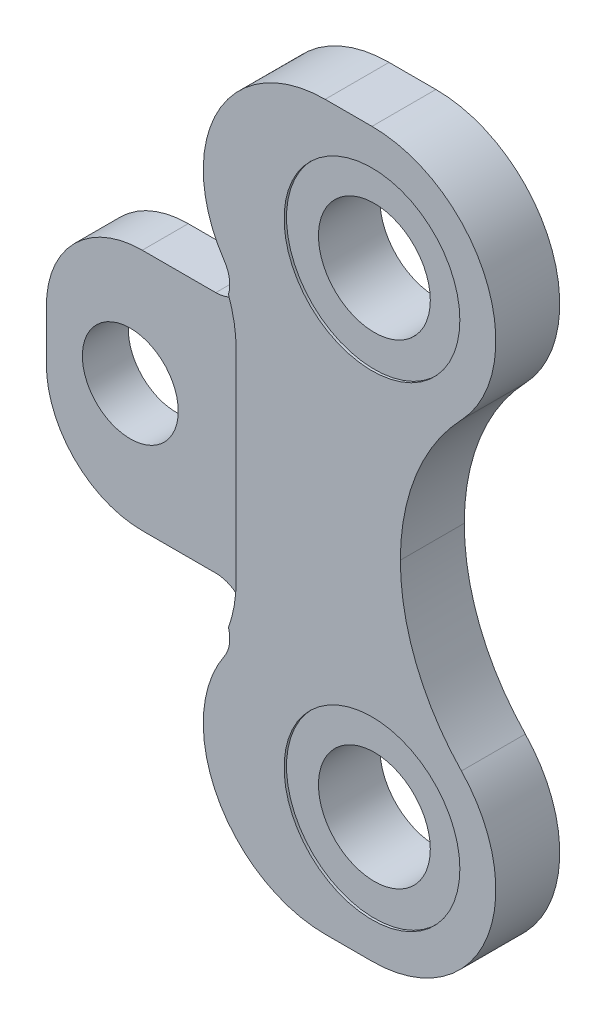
ISO-10303-21;
HEADER;
FILE_DESCRIPTION(('STEP AP214'),'2;1');
FILE_NAME('part.step','',(''),(''),'','','');
FILE_SCHEMA(('AUTOMOTIVE_DESIGN { 1 0 10303 214 1 1 1 1 }'));
ENDSEC;
DATA;
#1=APPLICATION_CONTEXT('core data for automotive mechanical design processes');
#2=APPLICATION_PROTOCOL_DEFINITION('international standard','automotive_design',2000,#1);
#3=PRODUCT_CONTEXT('',#1,'mechanical');
#4=PRODUCT('Part','Part','',(#3));
#5=PRODUCT_RELATED_PRODUCT_CATEGORY('part','',(#4));
#6=PRODUCT_DEFINITION_FORMATION('','',#4);
#7=PRODUCT_DEFINITION_CONTEXT('part definition',#1,'design');
#8=PRODUCT_DEFINITION('design','',#6,#7);
#9=PRODUCT_DEFINITION_SHAPE('','',#8);
#10=(LENGTH_UNIT() NAMED_UNIT(*) SI_UNIT(.MILLI.,.METRE.));
#11=(NAMED_UNIT(*) PLANE_ANGLE_UNIT() SI_UNIT($,.RADIAN.));
#12=(NAMED_UNIT(*) SI_UNIT($,.STERADIAN.) SOLID_ANGLE_UNIT());
#13=UNCERTAINTY_MEASURE_WITH_UNIT(LENGTH_MEASURE(1.E-05),#10,'distance_accuracy_value','');
#14=(GEOMETRIC_REPRESENTATION_CONTEXT(3) GLOBAL_UNCERTAINTY_ASSIGNED_CONTEXT((#13)) GLOBAL_UNIT_ASSIGNED_CONTEXT((#10,
#11,#12)) REPRESENTATION_CONTEXT('',''));
#15=CARTESIAN_POINT('',(0.,0.,0.));
#16=DIRECTION('',(0.,0.,1.));
#17=DIRECTION('',(1.,0.,0.));
#18=AXIS2_PLACEMENT_3D('',#15,#16,#17);
#19=CARTESIAN_POINT('',(1.5,3.2,8.));
#20=DIRECTION('',(0.,0.,-1.));
#21=DIRECTION('',(-1.,0.,0.));
#22=AXIS2_PLACEMENT_3D('',#19,#20,#21);
#23=PLANE('',#22);
#24=CARTESIAN_POINT('',(32.5,-29.75,8.));
#25=DIRECTION('',(0.,0.,-1.));
#26=DIRECTION('',(1.,0.,0.));
#27=AXIS2_PLACEMENT_3D('',#24,#25,#26);
#28=CIRCLE('',#27,11.);
#29=CARTESIAN_POINT('',(43.5,-29.75,8.));
#30=VERTEX_POINT('',#29);
#31=EDGE_CURVE('E217',#30,#30,#28,.T.);
#32=ORIENTED_EDGE('',*,*,#31,.T.);
#33=EDGE_LOOP('',(#32));
#34=FACE_BOUND('',#33,.T.);
#35=CARTESIAN_POINT('',(32.5,29.75,8.));
#36=DIRECTION('',(0.,0.,1.));
#37=DIRECTION('',(1.,0.,0.));
#38=AXIS2_PLACEMENT_3D('',#35,#36,#37);
#39=CIRCLE('',#38,11.);
#40=CARTESIAN_POINT('',(43.5,29.75,8.));
#41=VERTEX_POINT('',#40);
#42=EDGE_CURVE('E291',#41,#41,#39,.T.);
#43=ORIENTED_EDGE('',*,*,#42,.F.);
#44=EDGE_LOOP('',(#43));
#45=FACE_BOUND('',#44,.T.);
#46=CARTESIAN_POINT('',(-1.,-12.5,8.));
#47=DIRECTION('',(0.,0.,-1.));
#48=DIRECTION('',(1.,0.,0.));
#49=AXIS2_PLACEMENT_3D('',#46,#47,#48);
#50=CIRCLE('',#49,16.5);
#51=CARTESIAN_POINT('',(15.5,-12.5,8.));
#52=VERTEX_POINT('',#51);
#53=CARTESIAN_POINT('',(14.5342457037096,-18.0621228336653,8.));
#54=VERTEX_POINT('',#53);
#55=EDGE_CURVE('E201',#52,#54,#50,.T.);
#56=ORIENTED_EDGE('',*,*,#55,.T.);
#57=CARTESIAN_POINT('',(10.7,-19.201666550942,8.));
#58=DIRECTION('',(0.,0.,1.));
#59=DIRECTION('',(1.,0.,0.));
#60=AXIS2_PLACEMENT_3D('',#57,#58,#59);
#61=CIRCLE('',#60,4.);
#62=CARTESIAN_POINT('',(14.0113922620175,-21.4454760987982,8.));
#63=VERTEX_POINT('',#62);
#64=EDGE_CURVE('E228',#63,#54,#61,.T.);
#65=ORIENTED_EDGE('',*,*,#64,.F.);
#66=CARTESIAN_POINT('',(26.6360752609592,-30.,8.));
#67=DIRECTION('',(0.,0.,-1.));
#68=DIRECTION('',(1.,0.,0.));
#69=AXIS2_PLACEMENT_3D('',#66,#67,#68);
#70=CIRCLE('',#69,15.25);
#71=CARTESIAN_POINT('',(26.6360752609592,-45.25,8.));
#72=VERTEX_POINT('',#71);
#73=EDGE_CURVE('E231',#72,#63,#70,.T.);
#74=ORIENTED_EDGE('',*,*,#73,.F.);
#75=DIRECTION('',(-1.,0.,0.));
#76=VECTOR('',#75,1.);
#77=CARTESIAN_POINT('',(32.5,-45.25,8.));
#78=LINE('',#77,#76);
#79=CARTESIAN_POINT('',(32.5,-45.25,8.));
#80=VERTEX_POINT('',#79);
#81=EDGE_CURVE('E235',#80,#72,#78,.T.);
#82=ORIENTED_EDGE('',*,*,#81,.F.);
#83=CARTESIAN_POINT('',(32.5,-29.75,8.));
#84=DIRECTION('',(0.,0.,-1.));
#85=DIRECTION('',(-1.,0.,0.));
#86=AXIS2_PLACEMENT_3D('',#83,#84,#85);
#87=CIRCLE('',#86,15.5);
#88=CARTESIAN_POINT('',(43.6924418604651,-19.0271624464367,8.));
#89=VERTEX_POINT('',#88);
#90=EDGE_CURVE('E238',#89,#80,#87,.T.);
#91=ORIENTED_EDGE('',*,*,#90,.F.);
#92=CARTESIAN_POINT('',(63.55,-0.00277323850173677,8.));
#93=DIRECTION('',(0.,0.,1.));
#94=DIRECTION('',(1.,0.,0.));
#95=AXIS2_PLACEMENT_3D('',#92,#93,#94);
#96=CIRCLE('',#95,27.5);
#97=CARTESIAN_POINT('',(36.0500001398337,0.,8.));
#98=VERTEX_POINT('',#97);
#99=EDGE_CURVE('E241',#98,#89,#96,.T.);
#100=ORIENTED_EDGE('',*,*,#99,.F.);
#101=CARTESIAN_POINT('',(63.55,0.00277323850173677,8.));
#102=DIRECTION('',(0.,0.,-1.));
#103=DIRECTION('',(1.,0.,0.));
#104=AXIS2_PLACEMENT_3D('',#101,#102,#103);
#105=CIRCLE('',#104,27.5);
#106=CARTESIAN_POINT('',(43.6924418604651,19.0271624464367,8.));
#107=VERTEX_POINT('',#106);
#108=EDGE_CURVE('E104',#98,#107,#105,.T.);
#109=ORIENTED_EDGE('',*,*,#108,.T.);
#110=CARTESIAN_POINT('',(32.5,29.75,8.));
#111=DIRECTION('',(0.,0.,1.));
#112=DIRECTION('',(-1.,0.,0.));
#113=AXIS2_PLACEMENT_3D('',#110,#111,#112);
#114=CIRCLE('',#113,15.5);
#115=CARTESIAN_POINT('',(32.5,45.25,8.));
#116=VERTEX_POINT('',#115);
#117=EDGE_CURVE('E303',#107,#116,#114,.T.);
#118=ORIENTED_EDGE('',*,*,#117,.T.);
#119=DIRECTION('',(-1.,0.,0.));
#120=VECTOR('',#119,1.);
#121=CARTESIAN_POINT('',(32.5,45.25,8.));
#122=LINE('',#121,#120);
#123=CARTESIAN_POINT('',(26.6360752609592,45.25,8.));
#124=VERTEX_POINT('',#123);
#125=EDGE_CURVE('E306',#116,#124,#122,.T.);
#126=ORIENTED_EDGE('',*,*,#125,.T.);
#127=CARTESIAN_POINT('',(26.6360752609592,30.,8.));
#128=DIRECTION('',(0.,0.,1.));
#129=DIRECTION('',(1.,0.,0.));
#130=AXIS2_PLACEMENT_3D('',#127,#128,#129);
#131=CIRCLE('',#130,15.25);
#132=CARTESIAN_POINT('',(14.0113922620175,21.4454760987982,8.));
#133=VERTEX_POINT('',#132);
#134=EDGE_CURVE('E66',#124,#133,#131,.T.);
#135=ORIENTED_EDGE('',*,*,#134,.T.);
#136=CARTESIAN_POINT('',(10.7,19.201666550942,8.));
#137=DIRECTION('',(0.,0.,-1.));
#138=DIRECTION('',(1.,0.,0.));
#139=AXIS2_PLACEMENT_3D('',#136,#137,#138);
#140=CIRCLE('',#139,4.);
#141=CARTESIAN_POINT('',(14.5342457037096,18.0621228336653,8.));
#142=VERTEX_POINT('',#141);
#143=EDGE_CURVE('E309',#133,#142,#140,.T.);
#144=ORIENTED_EDGE('',*,*,#143,.T.);
#145=CARTESIAN_POINT('',(-1.,12.5,8.));
#146=DIRECTION('',(0.,0.,1.));
#147=DIRECTION('',(1.,0.,0.));
#148=AXIS2_PLACEMENT_3D('',#145,#146,#147);
#149=CIRCLE('',#148,16.5);
#150=CARTESIAN_POINT('',(15.5,12.5,8.));
#151=VERTEX_POINT('',#150);
#152=EDGE_CURVE('E277',#151,#142,#149,.T.);
#153=ORIENTED_EDGE('',*,*,#152,.F.);
#154=DIRECTION('',(0.,1.,0.));
#155=VECTOR('',#154,1.);
#156=CARTESIAN_POINT('',(15.5,12.5,8.));
#157=LINE('',#156,#155);
#158=EDGE_CURVE('E278',#52,#151,#157,.T.);
#159=ORIENTED_EDGE('',*,*,#158,.F.);
#160=EDGE_LOOP('',(#56,#65,#74,#82,#91,#100,#109,#118,#126,#135,#144,#153,#159));
#161=FACE_BOUND('',#160,.T.);
#162=ADVANCED_FACE('F42',(#34,#45,#161),#23,.F.);
#163=CARTESIAN_POINT('',(-10.5,0.,8.));
#164=DIRECTION('',(1.,0.,0.));
#165=DIRECTION('',(0.,0.,-1.));
#166=AXIS2_PLACEMENT_3D('',#163,#164,#165);
#167=PLANE('',#166);
#168=DIRECTION('',(0.,0.,-1.));
#169=VECTOR('',#168,1.);
#170=CARTESIAN_POINT('',(-10.5,-2.99999999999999,8.));
#171=LINE('',#170,#169);
#172=CARTESIAN_POINT('',(-10.5,-2.99999999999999,5.75));
#173=VERTEX_POINT('',#172);
#174=CARTESIAN_POINT('',(-10.5,-2.99999999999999,0.));
#175=VERTEX_POINT('',#174);
#176=EDGE_CURVE('E275',#173,#175,#171,.T.);
#177=ORIENTED_EDGE('',*,*,#176,.F.);
#178=DIRECTION('',(0.,-1.,0.));
#179=VECTOR('',#178,1.);
#180=CARTESIAN_POINT('',(-10.5,0.,5.75));
#181=LINE('',#180,#179);
#182=CARTESIAN_POINT('',(-10.5,2.99999999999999,5.75));
#183=VERTEX_POINT('',#182);
#184=EDGE_CURVE('E286',#183,#173,#181,.T.);
#185=ORIENTED_EDGE('',*,*,#184,.F.);
#186=DIRECTION('',(0.,0.,-1.));
#187=VECTOR('',#186,1.);
#188=CARTESIAN_POINT('',(-10.5,2.99999999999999,8.));
#189=LINE('',#188,#187);
#190=CARTESIAN_POINT('',(-10.5,2.99999999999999,0.));
#191=VERTEX_POINT('',#190);
#192=EDGE_CURVE('E97',#183,#191,#189,.T.);
#193=ORIENTED_EDGE('',*,*,#192,.T.);
#194=DIRECTION('',(0.,-1.,0.));
#195=VECTOR('',#194,1.);
#196=CARTESIAN_POINT('',(-10.5,0.,0.));
#197=LINE('',#196,#195);
#198=EDGE_CURVE('E301',#191,#175,#197,.T.);
#199=ORIENTED_EDGE('',*,*,#198,.T.);
#200=EDGE_LOOP('',(#177,#185,#193,#199));
#201=FACE_BOUND('',#200,.T.);
#202=ADVANCED_FACE('F44',(#201),#167,.F.);
#203=CARTESIAN_POINT('',(0.,0.,8.));
#204=DIRECTION('',(0.,0.,-1.));
#205=DIRECTION('',(-1.,0.,0.));
#206=AXIS2_PLACEMENT_3D('',#203,#204,#205);
#207=CYLINDRICAL_SURFACE('',#206,6.);
#208=CARTESIAN_POINT('',(0.,0.,0.));
#209=DIRECTION('',(0.,0.,-1.));
#210=DIRECTION('',(1.,0.,0.));
#211=AXIS2_PLACEMENT_3D('',#208,#209,#210);
#212=CIRCLE('',#211,6.);
#213=CARTESIAN_POINT('',(6.,0.,0.));
#214=VERTEX_POINT('',#213);
#215=EDGE_CURVE('E312',#214,#214,#212,.T.);
#216=ORIENTED_EDGE('',*,*,#215,.T.);
#217=EDGE_LOOP('',(#216));
#218=FACE_BOUND('',#217,.T.);
#219=CARTESIAN_POINT('',(0.,0.,5.75));
#220=DIRECTION('',(0.,0.,1.));
#221=DIRECTION('',(1.,0.,0.));
#222=AXIS2_PLACEMENT_3D('',#219,#220,#221);
#223=CIRCLE('',#222,6.);
#224=CARTESIAN_POINT('',(6.,0.,5.75));
#225=VERTEX_POINT('',#224);
#226=EDGE_CURVE('E288',#225,#225,#223,.F.);
#227=ORIENTED_EDGE('',*,*,#226,.F.);
#228=EDGE_LOOP('',(#227));
#229=FACE_BOUND('',#228,.T.);
#230=ADVANCED_FACE('F384',(#218,#229),#207,.F.);
#231=CARTESIAN_POINT('',(1.5,-3.2,8.));
#232=DIRECTION('',(0.,0.,-1.));
#233=DIRECTION('',(-1.,0.,0.));
#234=AXIS2_PLACEMENT_3D('',#231,#232,#233);
#235=CYLINDRICAL_SURFACE('',#234,12.001666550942);
#236=DIRECTION('',(0.,0.,-1.));
#237=VECTOR('',#236,1.);
#238=CARTESIAN_POINT('',(1.5,-15.201666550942,8.));
#239=LINE('',#238,#237);
#240=CARTESIAN_POINT('',(1.5,-15.201666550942,5.75));
#241=VERTEX_POINT('',#240);
#242=CARTESIAN_POINT('',(1.5,-15.201666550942,0.));
#243=VERTEX_POINT('',#242);
#244=EDGE_CURVE('E273',#241,#243,#239,.T.);
#245=ORIENTED_EDGE('',*,*,#244,.F.);
#246=CARTESIAN_POINT('',(1.5,-3.2,5.75));
#247=DIRECTION('',(0.,0.,1.));
#248=DIRECTION('',(1.,0.,0.));
#249=AXIS2_PLACEMENT_3D('',#246,#247,#248);
#250=CIRCLE('',#249,12.001666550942);
#251=EDGE_CURVE('E214',#241,#173,#250,.F.);
#252=ORIENTED_EDGE('',*,*,#251,.T.);
#253=ORIENTED_EDGE('',*,*,#176,.T.);
#254=CARTESIAN_POINT('',(1.5,-3.2,0.));
#255=DIRECTION('',(0.,0.,-1.));
#256=DIRECTION('',(-1.,0.,0.));
#257=AXIS2_PLACEMENT_3D('',#254,#255,#256);
#258=CIRCLE('',#257,12.001666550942);
#259=EDGE_CURVE('E227',#243,#175,#258,.T.);
#260=ORIENTED_EDGE('',*,*,#259,.F.);
#261=EDGE_LOOP('',(#245,#252,#253,#260));
#262=FACE_BOUND('',#261,.T.);
#263=ADVANCED_FACE('F418',(#262),#235,.T.);
#264=CARTESIAN_POINT('',(1.5,-15.201666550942,8.));
#265=DIRECTION('',(0.,-1.,0.));
#266=DIRECTION('',(0.,0.,-1.));
#267=AXIS2_PLACEMENT_3D('',#264,#265,#266);
#268=PLANE('',#267);
#269=DIRECTION('',(0.,0.,-1.));
#270=VECTOR('',#269,1.);
#271=CARTESIAN_POINT('',(10.7,-15.201666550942,8.));
#272=LINE('',#271,#270);
#273=CARTESIAN_POINT('',(10.7,-15.201666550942,5.75));
#274=VERTEX_POINT('',#273);
#275=CARTESIAN_POINT('',(10.7,-15.201666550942,0.));
#276=VERTEX_POINT('',#275);
#277=EDGE_CURVE('E271',#274,#276,#272,.T.);
#278=ORIENTED_EDGE('',*,*,#277,.F.);
#279=DIRECTION('',(-1.,0.,0.));
#280=VECTOR('',#279,1.);
#281=CARTESIAN_POINT('',(1.5,-15.201666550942,5.75));
#282=LINE('',#281,#280);
#283=EDGE_CURVE('E211',#274,#241,#282,.T.);
#284=ORIENTED_EDGE('',*,*,#283,.T.);
#285=ORIENTED_EDGE('',*,*,#244,.T.);
#286=DIRECTION('',(-1.,0.,0.));
#287=VECTOR('',#286,1.);
#288=CARTESIAN_POINT('',(1.5,-15.201666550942,0.));
#289=LINE('',#288,#287);
#290=EDGE_CURVE('E247',#276,#243,#289,.T.);
#291=ORIENTED_EDGE('',*,*,#290,.F.);
#292=EDGE_LOOP('',(#278,#284,#285,#291));
#293=FACE_BOUND('',#292,.T.);
#294=ADVANCED_FACE('F373',(#293),#268,.T.);
#295=CARTESIAN_POINT('',(10.7,-19.201666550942,8.));
#296=DIRECTION('',(0.,0.,-1.));
#297=DIRECTION('',(-1.,0.,0.));
#298=AXIS2_PLACEMENT_3D('',#295,#296,#297);
#299=CYLINDRICAL_SURFACE('',#298,4.);
#300=ORIENTED_EDGE('',*,*,#64,.T.);
#301=DIRECTION('',(0.,0.,1.));
#302=VECTOR('',#301,1.);
#303=CARTESIAN_POINT('',(14.5342457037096,-18.0621228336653,6.875));
#304=LINE('',#303,#302);
#305=CARTESIAN_POINT('',(14.5342457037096,-18.0621228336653,5.75));
#306=VERTEX_POINT('',#305);
#307=EDGE_CURVE('E13',#54,#306,#304,.F.);
#308=ORIENTED_EDGE('',*,*,#307,.T.);
#309=CARTESIAN_POINT('',(10.7,-19.201666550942,5.75));
#310=DIRECTION('',(0.,0.,1.));
#311=DIRECTION('',(1.,0.,0.));
#312=AXIS2_PLACEMENT_3D('',#309,#310,#311);
#313=CIRCLE('',#312,4.);
#314=EDGE_CURVE('E202',#306,#274,#313,.T.);
#315=ORIENTED_EDGE('',*,*,#314,.T.);
#316=ORIENTED_EDGE('',*,*,#277,.T.);
#317=CARTESIAN_POINT('',(10.7,-19.201666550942,0.));
#318=DIRECTION('',(0.,0.,1.));
#319=DIRECTION('',(1.,0.,0.));
#320=AXIS2_PLACEMENT_3D('',#317,#318,#319);
#321=CIRCLE('',#320,4.);
#322=CARTESIAN_POINT('',(14.0113922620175,-21.4454760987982,0.));
#323=VERTEX_POINT('',#322);
#324=EDGE_CURVE('E250',#323,#276,#321,.T.);
#325=ORIENTED_EDGE('',*,*,#324,.F.);
#326=DIRECTION('',(0.,0.,-1.));
#327=VECTOR('',#326,1.);
#328=CARTESIAN_POINT('',(14.0113922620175,-21.4454760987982,8.));
#329=LINE('',#328,#327);
#330=EDGE_CURVE('E269',#63,#323,#329,.T.);
#331=ORIENTED_EDGE('',*,*,#330,.F.);
#332=EDGE_LOOP('',(#300,#308,#315,#316,#325,#331));
#333=FACE_BOUND('',#332,.T.);
#334=ADVANCED_FACE('F363',(#333),#299,.F.);
#335=CARTESIAN_POINT('',(32.5,-29.75,8.));
#336=DIRECTION('',(0.,0.,-1.));
#337=DIRECTION('',(-1.,0.,0.));
#338=AXIS2_PLACEMENT_3D('',#335,#336,#337);
#339=CYLINDRICAL_SURFACE('',#338,7.);
#340=CARTESIAN_POINT('',(32.5,-29.75,0.));
#341=DIRECTION('',(0.,0.,-1.));
#342=DIRECTION('',(1.,0.,0.));
#343=AXIS2_PLACEMENT_3D('',#340,#341,#342);
#344=CIRCLE('',#343,7.);
#345=CARTESIAN_POINT('',(39.5,-29.75,0.));
#346=VERTEX_POINT('',#345);
#347=EDGE_CURVE('E224',#346,#346,#344,.T.);
#348=ORIENTED_EDGE('',*,*,#347,.T.);
#349=EDGE_LOOP('',(#348));
#350=FACE_BOUND('',#349,.T.);
#351=CARTESIAN_POINT('',(32.5,-29.75,7.7));
#352=DIRECTION('',(0.,0.,1.));
#353=DIRECTION('',(1.,0.,0.));
#354=AXIS2_PLACEMENT_3D('',#351,#352,#353);
#355=CIRCLE('',#354,7.);
#356=CARTESIAN_POINT('',(39.5,-29.75,7.7));
#357=VERTEX_POINT('',#356);
#358=EDGE_CURVE('E221',#357,#357,#355,.F.);
#359=ORIENTED_EDGE('',*,*,#358,.F.);
#360=EDGE_LOOP('',(#359));
#361=FACE_BOUND('',#360,.T.);
#362=ADVANCED_FACE('F360',(#350,#361),#339,.F.);
#363=CARTESIAN_POINT('',(1.5,15.201666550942,8.));
#364=DIRECTION('',(0.,-1.,0.));
#365=DIRECTION('',(0.,0.,-1.));
#366=AXIS2_PLACEMENT_3D('',#363,#364,#365);
#367=PLANE('',#366);
#368=DIRECTION('',(-1.,0.,0.));
#369=VECTOR('',#368,1.);
#370=CARTESIAN_POINT('',(1.5,15.201666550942,5.75));
#371=LINE('',#370,#369);
#372=CARTESIAN_POINT('',(10.7,15.201666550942,5.75));
#373=VERTEX_POINT('',#372);
#374=CARTESIAN_POINT('',(1.5,15.201666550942,5.75));
#375=VERTEX_POINT('',#374);
#376=EDGE_CURVE('E57',#373,#375,#371,.T.);
#377=ORIENTED_EDGE('',*,*,#376,.F.);
#378=DIRECTION('',(0.,0.,-1.));
#379=VECTOR('',#378,1.);
#380=CARTESIAN_POINT('',(10.7,15.201666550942,8.));
#381=LINE('',#380,#379);
#382=CARTESIAN_POINT('',(10.7,15.201666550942,0.));
#383=VERTEX_POINT('',#382);
#384=EDGE_CURVE('E333',#373,#383,#381,.T.);
#385=ORIENTED_EDGE('',*,*,#384,.T.);
#386=DIRECTION('',(-1.,0.,0.));
#387=VECTOR('',#386,1.);
#388=CARTESIAN_POINT('',(1.5,15.201666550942,0.));
#389=LINE('',#388,#387);
#390=CARTESIAN_POINT('',(1.5,15.201666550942,0.));
#391=VERTEX_POINT('',#390);
#392=EDGE_CURVE('E326',#383,#391,#389,.T.);
#393=ORIENTED_EDGE('',*,*,#392,.T.);
#394=DIRECTION('',(0.,0.,-1.));
#395=VECTOR('',#394,1.);
#396=CARTESIAN_POINT('',(1.5,15.201666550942,8.));
#397=LINE('',#396,#395);
#398=EDGE_CURVE('E331',#375,#391,#397,.T.);
#399=ORIENTED_EDGE('',*,*,#398,.F.);
#400=EDGE_LOOP('',(#377,#385,#393,#399));
#401=FACE_BOUND('',#400,.T.);
#402=ADVANCED_FACE('F362',(#401),#367,.F.);
#403=CARTESIAN_POINT('',(1.5,3.2,8.));
#404=DIRECTION('',(0.,0.,-1.));
#405=DIRECTION('',(-1.,0.,0.));
#406=AXIS2_PLACEMENT_3D('',#403,#404,#405);
#407=CYLINDRICAL_SURFACE('',#406,12.001666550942);
#408=CARTESIAN_POINT('',(1.5,3.2,5.75));
#409=DIRECTION('',(0.,0.,1.));
#410=DIRECTION('',(1.,0.,0.));
#411=AXIS2_PLACEMENT_3D('',#408,#409,#410);
#412=CIRCLE('',#411,12.001666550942);
#413=EDGE_CURVE('E350',#375,#183,#412,.T.);
#414=ORIENTED_EDGE('',*,*,#413,.F.);
#415=ORIENTED_EDGE('',*,*,#398,.T.);
#416=CARTESIAN_POINT('',(1.5,3.2,0.));
#417=DIRECTION('',(0.,0.,1.));
#418=DIRECTION('',(-1.,0.,0.));
#419=AXIS2_PLACEMENT_3D('',#416,#417,#418);
#420=CIRCLE('',#419,12.001666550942);
#421=EDGE_CURVE('E304',#391,#191,#420,.T.);
#422=ORIENTED_EDGE('',*,*,#421,.T.);
#423=ORIENTED_EDGE('',*,*,#192,.F.);
#424=EDGE_LOOP('',(#414,#415,#422,#423));
#425=FACE_BOUND('',#424,.T.);
#426=ADVANCED_FACE('F370',(#425),#407,.T.);
#427=CARTESIAN_POINT('',(32.5,29.75,8.));
#428=DIRECTION('',(0.,0.,-1.));
#429=DIRECTION('',(-1.,0.,0.));
#430=AXIS2_PLACEMENT_3D('',#427,#428,#429);
#431=CYLINDRICAL_SURFACE('',#430,7.);
#432=CARTESIAN_POINT('',(32.5,29.75,0.));
#433=DIRECTION('',(0.,0.,1.));
#434=DIRECTION('',(1.,0.,0.));
#435=AXIS2_PLACEMENT_3D('',#432,#433,#434);
#436=CIRCLE('',#435,7.);
#437=CARTESIAN_POINT('',(39.5,29.75,0.));
#438=VERTEX_POINT('',#437);
#439=EDGE_CURVE('E298',#438,#438,#436,.T.);
#440=ORIENTED_EDGE('',*,*,#439,.F.);
#441=EDGE_LOOP('',(#440));
#442=FACE_BOUND('',#441,.T.);
#443=CARTESIAN_POINT('',(32.5,29.75,7.7));
#444=DIRECTION('',(0.,0.,1.));
#445=DIRECTION('',(1.,0.,0.));
#446=AXIS2_PLACEMENT_3D('',#443,#444,#445);
#447=CIRCLE('',#446,7.);
#448=CARTESIAN_POINT('',(39.5,29.75,7.7));
#449=VERTEX_POINT('',#448);
#450=EDGE_CURVE('E295',#449,#449,#447,.T.);
#451=ORIENTED_EDGE('',*,*,#450,.T.);
#452=EDGE_LOOP('',(#451));
#453=FACE_BOUND('',#452,.T.);
#454=ADVANCED_FACE('F388',(#442,#453),#431,.F.);
#455=CARTESIAN_POINT('',(1.5,3.2,0.));
#456=DIRECTION('',(0.,0.,-1.));
#457=DIRECTION('',(-1.,0.,0.));
#458=AXIS2_PLACEMENT_3D('',#455,#456,#457);
#459=PLANE('',#458);
#460=ORIENTED_EDGE('',*,*,#215,.F.);
#461=EDGE_LOOP('',(#460));
#462=FACE_BOUND('',#461,.T.);
#463=ORIENTED_EDGE('',*,*,#198,.F.);
#464=ORIENTED_EDGE('',*,*,#421,.F.);
#465=ORIENTED_EDGE('',*,*,#392,.F.);
#466=CARTESIAN_POINT('',(10.7,19.201666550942,0.));
#467=DIRECTION('',(0.,0.,-1.));
#468=DIRECTION('',(1.,0.,0.));
#469=AXIS2_PLACEMENT_3D('',#466,#467,#468);
#470=CIRCLE('',#469,4.);
#471=CARTESIAN_POINT('',(14.0113922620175,21.4454760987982,0.));
#472=VERTEX_POINT('',#471);
#473=EDGE_CURVE('E323',#472,#383,#470,.T.);
#474=ORIENTED_EDGE('',*,*,#473,.F.);
#475=CARTESIAN_POINT('',(26.6360752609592,30.,0.));
#476=DIRECTION('',(0.,0.,1.));
#477=DIRECTION('',(1.,0.,0.));
#478=AXIS2_PLACEMENT_3D('',#475,#476,#477);
#479=CIRCLE('',#478,15.25);
#480=CARTESIAN_POINT('',(26.6360752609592,45.25,0.));
#481=VERTEX_POINT('',#480);
#482=EDGE_CURVE('E321',#481,#472,#479,.T.);
#483=ORIENTED_EDGE('',*,*,#482,.F.);
#484=DIRECTION('',(-1.,0.,0.));
#485=VECTOR('',#484,1.);
#486=CARTESIAN_POINT('',(32.5,45.25,0.));
#487=LINE('',#486,#485);
#488=CARTESIAN_POINT('',(32.5,45.25,0.));
#489=VERTEX_POINT('',#488);
#490=EDGE_CURVE('E319',#489,#481,#487,.T.);
#491=ORIENTED_EDGE('',*,*,#490,.F.);
#492=CARTESIAN_POINT('',(32.5,29.75,0.));
#493=DIRECTION('',(0.,0.,1.));
#494=DIRECTION('',(-1.,0.,0.));
#495=AXIS2_PLACEMENT_3D('',#492,#493,#494);
#496=CIRCLE('',#495,15.5);
#497=CARTESIAN_POINT('',(43.6924418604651,19.0271624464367,0.));
#498=VERTEX_POINT('',#497);
#499=EDGE_CURVE('E317',#498,#489,#496,.T.);
#500=ORIENTED_EDGE('',*,*,#499,.F.);
#501=CARTESIAN_POINT('',(63.55,0.00277323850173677,0.));
#502=DIRECTION('',(0.,0.,-1.));
#503=DIRECTION('',(1.,0.,0.));
#504=AXIS2_PLACEMENT_3D('',#501,#502,#503);
#505=CIRCLE('',#504,27.5);
#506=CARTESIAN_POINT('',(36.0500001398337,0.,0.));
#507=VERTEX_POINT('',#506);
#508=EDGE_CURVE('E315',#507,#498,#505,.T.);
#509=ORIENTED_EDGE('',*,*,#508,.F.);
#510=CARTESIAN_POINT('',(63.55,-0.00277323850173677,0.));
#511=DIRECTION('',(0.,0.,1.));
#512=DIRECTION('',(1.,0.,0.));
#513=AXIS2_PLACEMENT_3D('',#510,#511,#512);
#514=CIRCLE('',#513,27.5);
#515=CARTESIAN_POINT('',(43.6924418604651,-19.0271624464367,0.));
#516=VERTEX_POINT('',#515);
#517=EDGE_CURVE('E232',#507,#516,#514,.T.);
#518=ORIENTED_EDGE('',*,*,#517,.T.);
#519=CARTESIAN_POINT('',(32.5,-29.75,0.));
#520=DIRECTION('',(0.,0.,-1.));
#521=DIRECTION('',(-1.,0.,0.));
#522=AXIS2_PLACEMENT_3D('',#519,#520,#521);
#523=CIRCLE('',#522,15.5);
#524=CARTESIAN_POINT('',(32.5,-45.25,0.));
#525=VERTEX_POINT('',#524);
#526=EDGE_CURVE('E259',#516,#525,#523,.T.);
#527=ORIENTED_EDGE('',*,*,#526,.T.);
#528=DIRECTION('',(-1.,0.,0.));
#529=VECTOR('',#528,1.);
#530=CARTESIAN_POINT('',(32.5,-45.25,0.));
#531=LINE('',#530,#529);
#532=CARTESIAN_POINT('',(26.6360752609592,-45.25,0.));
#533=VERTEX_POINT('',#532);
#534=EDGE_CURVE('E256',#525,#533,#531,.T.);
#535=ORIENTED_EDGE('',*,*,#534,.T.);
#536=CARTESIAN_POINT('',(26.6360752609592,-30.,0.));
#537=DIRECTION('',(0.,0.,-1.));
#538=DIRECTION('',(1.,0.,0.));
#539=AXIS2_PLACEMENT_3D('',#536,#537,#538);
#540=CIRCLE('',#539,15.25);
#541=EDGE_CURVE('E253',#533,#323,#540,.T.);
#542=ORIENTED_EDGE('',*,*,#541,.T.);
#543=ORIENTED_EDGE('',*,*,#324,.T.);
#544=ORIENTED_EDGE('',*,*,#290,.T.);
#545=ORIENTED_EDGE('',*,*,#259,.T.);
#546=EDGE_LOOP('',(#463,#464,#465,#474,#483,#491,#500,#509,#518,#527,#535,#542,#543,#544,#545));
#547=FACE_BOUND('',#546,.T.);
#548=ORIENTED_EDGE('',*,*,#439,.T.);
#549=EDGE_LOOP('',(#548));
#550=FACE_BOUND('',#549,.T.);
#551=ORIENTED_EDGE('',*,*,#347,.F.);
#552=EDGE_LOOP('',(#551));
#553=FACE_BOUND('',#552,.T.);
#554=ADVANCED_FACE('F390',(#462,#547,#550,#553),#459,.T.);
#555=CARTESIAN_POINT('',(63.55,0.00277323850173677,8.));
#556=DIRECTION('',(0.,0.,-1.));
#557=DIRECTION('',(-1.,0.,0.));
#558=AXIS2_PLACEMENT_3D('',#555,#556,#557);
#559=CYLINDRICAL_SURFACE('',#558,27.5);
#560=ORIENTED_EDGE('',*,*,#508,.T.);
#561=DIRECTION('',(0.,0.,-1.));
#562=VECTOR('',#561,1.);
#563=CARTESIAN_POINT('',(43.6924418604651,19.0271624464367,8.));
#564=LINE('',#563,#562);
#565=EDGE_CURVE('E344',#107,#498,#564,.T.);
#566=ORIENTED_EDGE('',*,*,#565,.F.);
#567=ORIENTED_EDGE('',*,*,#108,.F.);
#568=DIRECTION('',(0.,0.,-1.));
#569=VECTOR('',#568,1.);
#570=CARTESIAN_POINT('',(36.0500001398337,0.,8.));
#571=LINE('',#570,#569);
#572=EDGE_CURVE('E347',#98,#507,#571,.T.);
#573=ORIENTED_EDGE('',*,*,#572,.T.);
#574=EDGE_LOOP('',(#560,#566,#567,#573));
#575=FACE_BOUND('',#574,.T.);
#576=ADVANCED_FACE('F393',(#575),#559,.F.);
#577=CARTESIAN_POINT('',(32.5,29.75,8.));
#578=DIRECTION('',(0.,0.,-1.));
#579=DIRECTION('',(-1.,0.,0.));
#580=AXIS2_PLACEMENT_3D('',#577,#578,#579);
#581=CYLINDRICAL_SURFACE('',#580,15.5);
#582=ORIENTED_EDGE('',*,*,#499,.T.);
#583=DIRECTION('',(0.,0.,-1.));
#584=VECTOR('',#583,1.);
#585=CARTESIAN_POINT('',(32.5,45.25,8.));
#586=LINE('',#585,#584);
#587=EDGE_CURVE('E341',#116,#489,#586,.T.);
#588=ORIENTED_EDGE('',*,*,#587,.F.);
#589=ORIENTED_EDGE('',*,*,#117,.F.);
#590=ORIENTED_EDGE('',*,*,#565,.T.);
#591=EDGE_LOOP('',(#582,#588,#589,#590));
#592=FACE_BOUND('',#591,.T.);
#593=ADVANCED_FACE('F410',(#592),#581,.T.);
#594=CARTESIAN_POINT('',(32.5,45.25,8.));
#595=DIRECTION('',(0.,-1.,0.));
#596=DIRECTION('',(0.,0.,-1.));
#597=AXIS2_PLACEMENT_3D('',#594,#595,#596);
#598=PLANE('',#597);
#599=ORIENTED_EDGE('',*,*,#490,.T.);
#600=DIRECTION('',(0.,0.,-1.));
#601=VECTOR('',#600,1.);
#602=CARTESIAN_POINT('',(26.6360752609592,45.25,8.));
#603=LINE('',#602,#601);
#604=EDGE_CURVE('E338',#124,#481,#603,.T.);
#605=ORIENTED_EDGE('',*,*,#604,.F.);
#606=ORIENTED_EDGE('',*,*,#125,.F.);
#607=ORIENTED_EDGE('',*,*,#587,.T.);
#608=EDGE_LOOP('',(#599,#605,#606,#607));
#609=FACE_BOUND('',#608,.T.);
#610=ADVANCED_FACE('F406',(#609),#598,.F.);
#611=CARTESIAN_POINT('',(26.6360752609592,30.,8.));
#612=DIRECTION('',(0.,0.,-1.));
#613=DIRECTION('',(-1.,0.,0.));
#614=AXIS2_PLACEMENT_3D('',#611,#612,#613);
#615=CYLINDRICAL_SURFACE('',#614,15.25);
#616=ORIENTED_EDGE('',*,*,#482,.T.);
#617=DIRECTION('',(0.,0.,-1.));
#618=VECTOR('',#617,1.);
#619=CARTESIAN_POINT('',(14.0113922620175,21.4454760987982,8.));
#620=LINE('',#619,#618);
#621=EDGE_CURVE('E335',#133,#472,#620,.T.);
#622=ORIENTED_EDGE('',*,*,#621,.F.);
#623=ORIENTED_EDGE('',*,*,#134,.F.);
#624=ORIENTED_EDGE('',*,*,#604,.T.);
#625=EDGE_LOOP('',(#616,#622,#623,#624));
#626=FACE_BOUND('',#625,.T.);
#627=ADVANCED_FACE('F402',(#626),#615,.T.);
#628=CARTESIAN_POINT('',(10.7,19.201666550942,8.));
#629=DIRECTION('',(0.,0.,-1.));
#630=DIRECTION('',(-1.,0.,0.));
#631=AXIS2_PLACEMENT_3D('',#628,#629,#630);
#632=CYLINDRICAL_SURFACE('',#631,4.);
#633=CARTESIAN_POINT('',(10.7,19.201666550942,5.75));
#634=DIRECTION('',(0.,0.,1.));
#635=DIRECTION('',(1.,0.,0.));
#636=AXIS2_PLACEMENT_3D('',#633,#634,#635);
#637=CIRCLE('',#636,4.);
#638=CARTESIAN_POINT('',(14.5342457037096,18.0621228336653,5.75));
#639=VERTEX_POINT('',#638);
#640=EDGE_CURVE('E284',#639,#373,#637,.F.);
#641=ORIENTED_EDGE('',*,*,#640,.F.);
#642=DIRECTION('',(0.,0.,1.));
#643=VECTOR('',#642,1.);
#644=CARTESIAN_POINT('',(14.5342457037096,18.0621228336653,6.875));
#645=LINE('',#644,#643);
#646=EDGE_CURVE('E50',#639,#142,#645,.T.);
#647=ORIENTED_EDGE('',*,*,#646,.T.);
#648=ORIENTED_EDGE('',*,*,#143,.F.);
#649=ORIENTED_EDGE('',*,*,#621,.T.);
#650=ORIENTED_EDGE('',*,*,#473,.T.);
#651=ORIENTED_EDGE('',*,*,#384,.F.);
#652=EDGE_LOOP('',(#641,#647,#648,#649,#650,#651));
#653=FACE_BOUND('',#652,.T.);
#654=ADVANCED_FACE('F398',(#653),#632,.F.);
#655=CARTESIAN_POINT('',(32.5,29.75,7.7));
#656=DIRECTION('',(0.,0.,1.));
#657=DIRECTION('',(1.,0.,0.));
#658=AXIS2_PLACEMENT_3D('',#655,#656,#657);
#659=CYLINDRICAL_SURFACE('',#658,11.);
#660=CARTESIAN_POINT('',(32.5,29.75,7.7));
#661=DIRECTION('',(0.,0.,1.));
#662=DIRECTION('',(1.,0.,0.));
#663=AXIS2_PLACEMENT_3D('',#660,#661,#662);
#664=CIRCLE('',#663,11.);
#665=CARTESIAN_POINT('',(43.5,29.75,7.7));
#666=VERTEX_POINT('',#665);
#667=EDGE_CURVE('E292',#666,#666,#664,.T.);
#668=ORIENTED_EDGE('',*,*,#667,.F.);
#669=EDGE_LOOP('',(#668));
#670=FACE_BOUND('',#669,.T.);
#671=ORIENTED_EDGE('',*,*,#42,.T.);
#672=EDGE_LOOP('',(#671));
#673=FACE_BOUND('',#672,.T.);
#674=ADVANCED_FACE('F401',(#670,#673),#659,.F.);
#675=CARTESIAN_POINT('',(32.5,29.75,7.7));
#676=DIRECTION('',(0.,0.,1.));
#677=DIRECTION('',(1.,0.,0.));
#678=AXIS2_PLACEMENT_3D('',#675,#676,#677);
#679=PLANE('',#678);
#680=ORIENTED_EDGE('',*,*,#450,.F.);
#681=EDGE_LOOP('',(#680));
#682=FACE_BOUND('',#681,.T.);
#683=ORIENTED_EDGE('',*,*,#667,.T.);
#684=EDGE_LOOP('',(#683));
#685=FACE_BOUND('',#684,.T.);
#686=ADVANCED_FACE('F437',(#682,#685),#679,.T.);
#687=CARTESIAN_POINT('',(-1.,12.5,5.75));
#688=DIRECTION('',(0.,0.,1.));
#689=DIRECTION('',(1.,0.,0.));
#690=AXIS2_PLACEMENT_3D('',#687,#688,#689);
#691=CYLINDRICAL_SURFACE('',#690,16.5);
#692=CARTESIAN_POINT('',(-1.,12.5,5.75));
#693=DIRECTION('',(0.,0.,1.));
#694=DIRECTION('',(1.,0.,0.));
#695=AXIS2_PLACEMENT_3D('',#692,#693,#694);
#696=CIRCLE('',#695,16.5);
#697=CARTESIAN_POINT('',(15.5,12.5,5.75));
#698=VERTEX_POINT('',#697);
#699=EDGE_CURVE('E194',#698,#639,#696,.T.);
#700=ORIENTED_EDGE('',*,*,#699,.F.);
#701=DIRECTION('',(0.,0.,1.));
#702=VECTOR('',#701,1.);
#703=CARTESIAN_POINT('',(15.5,12.5,5.75));
#704=LINE('',#703,#702);
#705=EDGE_CURVE('E190',#698,#151,#704,.T.);
#706=ORIENTED_EDGE('',*,*,#705,.T.);
#707=ORIENTED_EDGE('',*,*,#152,.T.);
#708=ORIENTED_EDGE('',*,*,#646,.F.);
#709=EDGE_LOOP('',(#700,#706,#707,#708));
#710=FACE_BOUND('',#709,.T.);
#711=ADVANCED_FACE('F429',(#710),#691,.F.);
#712=CARTESIAN_POINT('',(-1.,12.5,5.75));
#713=DIRECTION('',(0.,0.,1.));
#714=DIRECTION('',(1.,0.,0.));
#715=AXIS2_PLACEMENT_3D('',#712,#713,#714);
#716=PLANE('',#715);
#717=CARTESIAN_POINT('',(-1.,-12.5,5.75));
#718=DIRECTION('',(0.,0.,-1.));
#719=DIRECTION('',(1.,0.,0.));
#720=AXIS2_PLACEMENT_3D('',#717,#718,#719);
#721=CIRCLE('',#720,16.5);
#722=CARTESIAN_POINT('',(15.5,-12.5,5.75));
#723=VERTEX_POINT('',#722);
#724=EDGE_CURVE('E199',#723,#306,#721,.T.);
#725=ORIENTED_EDGE('',*,*,#724,.F.);
#726=DIRECTION('',(0.,1.,0.));
#727=VECTOR('',#726,1.);
#728=CARTESIAN_POINT('',(15.5,12.5,5.75));
#729=LINE('',#728,#727);
#730=EDGE_CURVE('E184',#723,#698,#729,.T.);
#731=ORIENTED_EDGE('',*,*,#730,.T.);
#732=ORIENTED_EDGE('',*,*,#699,.T.);
#733=ORIENTED_EDGE('',*,*,#640,.T.);
#734=ORIENTED_EDGE('',*,*,#376,.T.);
#735=ORIENTED_EDGE('',*,*,#413,.T.);
#736=ORIENTED_EDGE('',*,*,#184,.T.);
#737=ORIENTED_EDGE('',*,*,#251,.F.);
#738=ORIENTED_EDGE('',*,*,#283,.F.);
#739=ORIENTED_EDGE('',*,*,#314,.F.);
#740=EDGE_LOOP('',(#725,#731,#732,#733,#734,#735,#736,#737,#738,#739));
#741=FACE_BOUND('',#740,.T.);
#742=ORIENTED_EDGE('',*,*,#226,.T.);
#743=EDGE_LOOP('',(#742));
#744=FACE_BOUND('',#743,.T.);
#745=ADVANCED_FACE('F204',(#741,#744),#716,.T.);
#746=CARTESIAN_POINT('',(15.5,12.5,5.75));
#747=DIRECTION('',(1.,0.,0.));
#748=DIRECTION('',(0.,0.,-1.));
#749=AXIS2_PLACEMENT_3D('',#746,#747,#748);
#750=PLANE('',#749);
#751=ORIENTED_EDGE('',*,*,#158,.T.);
#752=ORIENTED_EDGE('',*,*,#705,.F.);
#753=ORIENTED_EDGE('',*,*,#730,.F.);
#754=DIRECTION('',(0.,0.,1.));
#755=VECTOR('',#754,1.);
#756=CARTESIAN_POINT('',(15.5,-12.5,5.75));
#757=LINE('',#756,#755);
#758=EDGE_CURVE('E188',#723,#52,#757,.T.);
#759=ORIENTED_EDGE('',*,*,#758,.T.);
#760=EDGE_LOOP('',(#751,#752,#753,#759));
#761=FACE_BOUND('',#760,.T.);
#762=ADVANCED_FACE('F187',(#761),#750,.F.);
#763=CARTESIAN_POINT('',(26.6360752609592,-30.,8.));
#764=DIRECTION('',(0.,0.,-1.));
#765=DIRECTION('',(-1.,0.,0.));
#766=AXIS2_PLACEMENT_3D('',#763,#764,#765);
#767=CYLINDRICAL_SURFACE('',#766,15.25);
#768=ORIENTED_EDGE('',*,*,#541,.F.);
#769=DIRECTION('',(0.,0.,-1.));
#770=VECTOR('',#769,1.);
#771=CARTESIAN_POINT('',(26.6360752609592,-45.25,8.));
#772=LINE('',#771,#770);
#773=EDGE_CURVE('E267',#72,#533,#772,.T.);
#774=ORIENTED_EDGE('',*,*,#773,.F.);
#775=ORIENTED_EDGE('',*,*,#73,.T.);
#776=ORIENTED_EDGE('',*,*,#330,.T.);
#777=EDGE_LOOP('',(#768,#774,#775,#776));
#778=FACE_BOUND('',#777,.T.);
#779=ADVANCED_FACE('F435',(#778),#767,.T.);
#780=CARTESIAN_POINT('',(32.5,-45.25,8.));
#781=DIRECTION('',(0.,-1.,0.));
#782=DIRECTION('',(0.,0.,-1.));
#783=AXIS2_PLACEMENT_3D('',#780,#781,#782);
#784=PLANE('',#783);
#785=ORIENTED_EDGE('',*,*,#534,.F.);
#786=DIRECTION('',(0.,0.,-1.));
#787=VECTOR('',#786,1.);
#788=CARTESIAN_POINT('',(32.5,-45.25,8.));
#789=LINE('',#788,#787);
#790=EDGE_CURVE('E265',#80,#525,#789,.T.);
#791=ORIENTED_EDGE('',*,*,#790,.F.);
#792=ORIENTED_EDGE('',*,*,#81,.T.);
#793=ORIENTED_EDGE('',*,*,#773,.T.);
#794=EDGE_LOOP('',(#785,#791,#792,#793));
#795=FACE_BOUND('',#794,.T.);
#796=ADVANCED_FACE('F461',(#795),#784,.T.);
#797=CARTESIAN_POINT('',(32.5,-29.75,8.));
#798=DIRECTION('',(0.,0.,-1.));
#799=DIRECTION('',(-1.,0.,0.));
#800=AXIS2_PLACEMENT_3D('',#797,#798,#799);
#801=CYLINDRICAL_SURFACE('',#800,15.5);
#802=ORIENTED_EDGE('',*,*,#526,.F.);
#803=DIRECTION('',(0.,0.,-1.));
#804=VECTOR('',#803,1.);
#805=CARTESIAN_POINT('',(43.6924418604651,-19.0271624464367,8.));
#806=LINE('',#805,#804);
#807=EDGE_CURVE('E244',#89,#516,#806,.T.);
#808=ORIENTED_EDGE('',*,*,#807,.F.);
#809=ORIENTED_EDGE('',*,*,#90,.T.);
#810=ORIENTED_EDGE('',*,*,#790,.T.);
#811=EDGE_LOOP('',(#802,#808,#809,#810));
#812=FACE_BOUND('',#811,.T.);
#813=ADVANCED_FACE('F464',(#812),#801,.T.);
#814=CARTESIAN_POINT('',(63.55,-0.00277323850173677,8.));
#815=DIRECTION('',(0.,0.,-1.));
#816=DIRECTION('',(-1.,0.,0.));
#817=AXIS2_PLACEMENT_3D('',#814,#815,#816);
#818=CYLINDRICAL_SURFACE('',#817,27.5);
#819=ORIENTED_EDGE('',*,*,#517,.F.);
#820=ORIENTED_EDGE('',*,*,#572,.F.);
#821=ORIENTED_EDGE('',*,*,#99,.T.);
#822=ORIENTED_EDGE('',*,*,#807,.T.);
#823=EDGE_LOOP('',(#819,#820,#821,#822));
#824=FACE_BOUND('',#823,.T.);
#825=ADVANCED_FACE('F466',(#824),#818,.F.);
#826=CARTESIAN_POINT('',(32.5,-29.75,7.7));
#827=DIRECTION('',(0.,0.,1.));
#828=DIRECTION('',(1.,0.,0.));
#829=AXIS2_PLACEMENT_3D('',#826,#827,#828);
#830=PLANE('',#829);
#831=CARTESIAN_POINT('',(32.5,-29.75,7.7));
#832=DIRECTION('',(0.,0.,-1.));
#833=DIRECTION('',(1.,0.,0.));
#834=AXIS2_PLACEMENT_3D('',#831,#832,#833);
#835=CIRCLE('',#834,11.);
#836=CARTESIAN_POINT('',(43.5,-29.75,7.7));
#837=VERTEX_POINT('',#836);
#838=EDGE_CURVE('E218',#837,#837,#835,.T.);
#839=ORIENTED_EDGE('',*,*,#838,.F.);
#840=EDGE_LOOP('',(#839));
#841=FACE_BOUND('',#840,.T.);
#842=ORIENTED_EDGE('',*,*,#358,.T.);
#843=EDGE_LOOP('',(#842));
#844=FACE_BOUND('',#843,.T.);
#845=ADVANCED_FACE('F358',(#841,#844),#830,.T.);
#846=CARTESIAN_POINT('',(32.5,-29.75,7.7));
#847=DIRECTION('',(0.,0.,1.));
#848=DIRECTION('',(1.,0.,0.));
#849=AXIS2_PLACEMENT_3D('',#846,#847,#848);
#850=CYLINDRICAL_SURFACE('',#849,11.);
#851=ORIENTED_EDGE('',*,*,#838,.T.);
#852=EDGE_LOOP('',(#851));
#853=FACE_BOUND('',#852,.T.);
#854=ORIENTED_EDGE('',*,*,#31,.F.);
#855=EDGE_LOOP('',(#854));
#856=FACE_BOUND('',#855,.T.);
#857=ADVANCED_FACE('F504',(#853,#856),#850,.F.);
#858=CARTESIAN_POINT('',(-1.,-12.5,5.75));
#859=DIRECTION('',(0.,0.,1.));
#860=DIRECTION('',(1.,0.,0.));
#861=AXIS2_PLACEMENT_3D('',#858,#859,#860);
#862=CYLINDRICAL_SURFACE('',#861,16.5);
#863=ORIENTED_EDGE('',*,*,#55,.F.);
#864=ORIENTED_EDGE('',*,*,#758,.F.);
#865=ORIENTED_EDGE('',*,*,#724,.T.);
#866=ORIENTED_EDGE('',*,*,#307,.F.);
#867=EDGE_LOOP('',(#863,#864,#865,#866));
#868=FACE_BOUND('',#867,.T.);
#869=ADVANCED_FACE('F198',(#868),#862,.F.);
#870=CLOSED_SHELL('',(#162,#202,#230,#263,#294,#334,#362,#402,#426,#454,#554,#576,#593,#610,
#627,#654,#674,#686,#711,#745,#762,#779,#796,#813,#825,#845,#857,#869));
#871=MANIFOLD_SOLID_BREP('B2',#870);
#872=ADVANCED_BREP_SHAPE_REPRESENTATION('',(#18,#871),#14);
#873=SHAPE_DEFINITION_REPRESENTATION(#9,#872);
ENDSEC;
END-ISO-10303-21;
